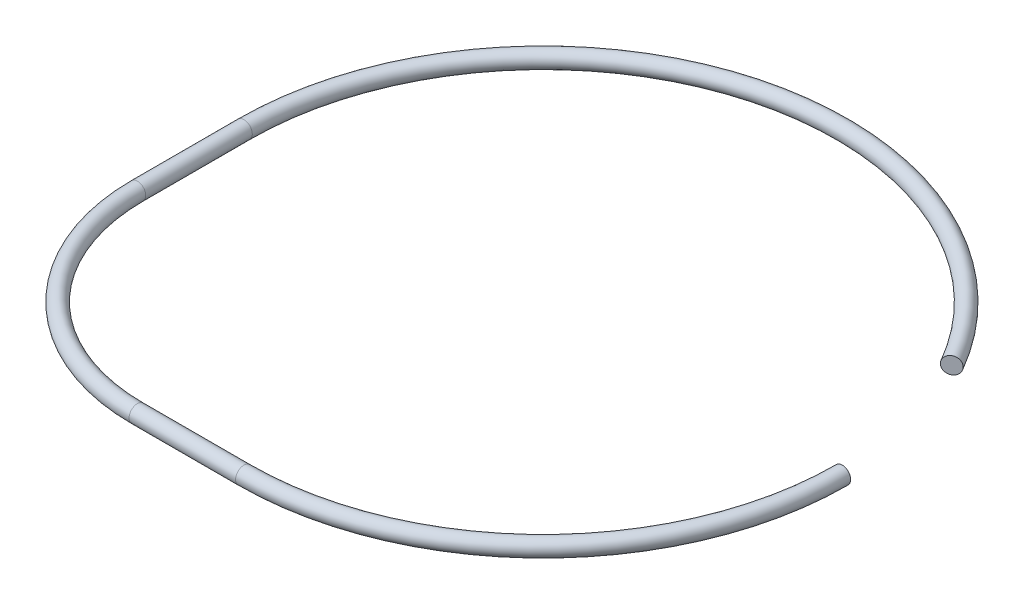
ISO-10303-21;
HEADER;
FILE_DESCRIPTION(('STEP AP214'),'2;1');
FILE_NAME('part.step','',(''),(''),'','','');
FILE_SCHEMA(('AUTOMOTIVE_DESIGN { 1 0 10303 214 1 1 1 1 }'));
ENDSEC;
DATA;
#1=APPLICATION_CONTEXT('core data for automotive mechanical design processes');
#2=APPLICATION_PROTOCOL_DEFINITION('international standard','automotive_design',2000,#1);
#3=PRODUCT_CONTEXT('',#1,'mechanical');
#4=PRODUCT('Part','Part','',(#3));
#5=PRODUCT_RELATED_PRODUCT_CATEGORY('part','',(#4));
#6=PRODUCT_DEFINITION_FORMATION('','',#4);
#7=PRODUCT_DEFINITION_CONTEXT('part definition',#1,'design');
#8=PRODUCT_DEFINITION('design','',#6,#7);
#9=PRODUCT_DEFINITION_SHAPE('','',#8);
#10=(LENGTH_UNIT() NAMED_UNIT(*) SI_UNIT(.MILLI.,.METRE.));
#11=(NAMED_UNIT(*) PLANE_ANGLE_UNIT() SI_UNIT($,.RADIAN.));
#12=(NAMED_UNIT(*) SI_UNIT($,.STERADIAN.) SOLID_ANGLE_UNIT());
#13=UNCERTAINTY_MEASURE_WITH_UNIT(LENGTH_MEASURE(1.E-05),#10,'distance_accuracy_value','');
#14=(GEOMETRIC_REPRESENTATION_CONTEXT(3) GLOBAL_UNCERTAINTY_ASSIGNED_CONTEXT((#13)) GLOBAL_UNIT_ASSIGNED_CONTEXT((#10,
#11,#12)) REPRESENTATION_CONTEXT('',''));
#15=CARTESIAN_POINT('',(0.,0.,0.));
#16=DIRECTION('',(0.,0.,1.));
#17=DIRECTION('',(1.,0.,0.));
#18=AXIS2_PLACEMENT_3D('',#15,#16,#17);
#19=CARTESIAN_POINT('',(0.,0.,0.));
#20=DIRECTION('',(0.,-1.,0.));
#21=DIRECTION('',(0.,0.,-1.));
#22=AXIS2_PLACEMENT_3D('',#19,#20,#21);
#23=TOROIDAL_SURFACE('',#22,56.7499500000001,1.5875);
#24=CARTESIAN_POINT('',(-56.7499500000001,0.,0.));
#25=DIRECTION('',(0.,0.,-1.));
#26=DIRECTION('',(-1.,0.,0.));
#27=AXIS2_PLACEMENT_3D('',#24,#25,#26);
#28=CIRCLE('',#27,1.5875);
#29=CARTESIAN_POINT('',(-58.3374500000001,0.,0.));
#30=VERTEX_POINT('',#29);
#31=EDGE_CURVE('E38',#30,#30,#28,.T.);
#32=CARTESIAN_POINT('',(49.1468983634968,0.,-28.3749749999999));
#33=DIRECTION('',(0.499999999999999,0.,0.866025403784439));
#34=DIRECTION('',(0.866025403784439,0.,-0.499999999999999));
#35=AXIS2_PLACEMENT_3D('',#32,#33,#34);
#36=CIRCLE('',#35,1.5875);
#37=CARTESIAN_POINT('',(50.5217136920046,0.,-29.1687249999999));
#38=VERTEX_POINT('',#37);
#39=EDGE_CURVE('E10',#38,#38,#36,.T.);
#40=CARTESIAN_POINT('',(0.,0.,0.));
#41=DIRECTION('',(0.,-1.,0.));
#42=DIRECTION('',(0.,0.,-1.));
#43=AXIS2_PLACEMENT_3D('',#40,#41,#42);
#44=CIRCLE('',#43,58.3374500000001);
#45=EDGE_CURVE('',#30,#38,#44,.T.);
#46=ORIENTED_EDGE('',*,*,#31,.T.);
#47=ORIENTED_EDGE('',*,*,#39,.F.);
#48=ORIENTED_EDGE('',*,*,#45,.T.);
#49=ORIENTED_EDGE('',*,*,#45,.F.);
#50=EDGE_LOOP('',(#46,#48,#47,#49));
#51=FACE_BOUND('',#50,.T.);
#52=ADVANCED_FACE('F32',(#51),#23,.T.);
#53=CARTESIAN_POINT('',(-56.74995,0.,20.2055762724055));
#54=DIRECTION('',(0.,0.,-1.));
#55=DIRECTION('',(-1.,0.,0.));
#56=AXIS2_PLACEMENT_3D('',#53,#54,#55);
#57=CYLINDRICAL_SURFACE('',#56,1.5875);
#58=CARTESIAN_POINT('',(-56.74995,0.,20.2055762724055));
#59=DIRECTION('',(0.,0.,-1.));
#60=DIRECTION('',(-1.,0.,0.));
#61=AXIS2_PLACEMENT_3D('',#58,#59,#60);
#62=CIRCLE('',#61,1.5875);
#63=CARTESIAN_POINT('',(-58.33745,0.,20.2055762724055));
#64=VERTEX_POINT('',#63);
#65=EDGE_CURVE('E42',#64,#64,#62,.T.);
#66=ORIENTED_EDGE('',*,*,#65,.T.);
#67=EDGE_LOOP('',(#66));
#68=FACE_BOUND('',#67,.T.);
#69=ORIENTED_EDGE('',*,*,#31,.F.);
#70=EDGE_LOOP('',(#69));
#71=FACE_BOUND('',#70,.T.);
#72=ADVANCED_FACE('F69',(#68,#71),#57,.T.);
#73=CARTESIAN_POINT('',(-20.2055762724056,0.,20.2055762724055));
#74=DIRECTION('',(0.,-1.,0.));
#75=DIRECTION('',(0.,0.,-1.));
#76=AXIS2_PLACEMENT_3D('',#73,#74,#75);
#77=TOROIDAL_SURFACE('',#76,36.5443737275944,1.5875);
#78=CARTESIAN_POINT('',(-20.2055762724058,0.,56.74995));
#79=DIRECTION('',(-1.,0.,0.));
#80=DIRECTION('',(0.,0.,1.));
#81=AXIS2_PLACEMENT_3D('',#78,#79,#80);
#82=CIRCLE('',#81,1.5875);
#83=CARTESIAN_POINT('',(-20.2055762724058,0.,58.33745));
#84=VERTEX_POINT('',#83);
#85=EDGE_CURVE('E46',#84,#84,#82,.T.);
#86=CARTESIAN_POINT('',(-20.2055762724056,0.,20.2055762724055));
#87=DIRECTION('',(0.,-1.,0.));
#88=DIRECTION('',(0.,0.,-1.));
#89=AXIS2_PLACEMENT_3D('',#86,#87,#88);
#90=CIRCLE('',#89,38.1318737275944);
#91=EDGE_CURVE('',#84,#64,#90,.T.);
#92=ORIENTED_EDGE('',*,*,#85,.T.);
#93=ORIENTED_EDGE('',*,*,#65,.F.);
#94=ORIENTED_EDGE('',*,*,#91,.T.);
#95=ORIENTED_EDGE('',*,*,#91,.F.);
#96=EDGE_LOOP('',(#92,#94,#93,#95));
#97=FACE_BOUND('',#96,.T.);
#98=ADVANCED_FACE('F73',(#97),#77,.T.);
#99=CARTESIAN_POINT('',(-1.98141391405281E-13,0.,56.74995));
#100=DIRECTION('',(-1.,0.,0.));
#101=DIRECTION('',(0.,0.,1.));
#102=AXIS2_PLACEMENT_3D('',#99,#100,#101);
#103=CYLINDRICAL_SURFACE('',#102,1.5875);
#104=CARTESIAN_POINT('',(-1.98141391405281E-13,0.,56.74995));
#105=DIRECTION('',(-1.,0.,0.));
#106=DIRECTION('',(0.,0.,1.));
#107=AXIS2_PLACEMENT_3D('',#104,#105,#106);
#108=CIRCLE('',#107,1.5875);
#109=CARTESIAN_POINT('',(-2.03684118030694E-13,0.,58.33745));
#110=VERTEX_POINT('',#109);
#111=EDGE_CURVE('E51',#110,#110,#108,.T.);
#112=ORIENTED_EDGE('',*,*,#111,.T.);
#113=EDGE_LOOP('',(#112));
#114=FACE_BOUND('',#113,.T.);
#115=ORIENTED_EDGE('',*,*,#85,.F.);
#116=EDGE_LOOP('',(#115));
#117=FACE_BOUND('',#116,.T.);
#118=ADVANCED_FACE('F79',(#114,#117),#103,.T.);
#119=CARTESIAN_POINT('',(0.,0.,0.));
#120=DIRECTION('',(0.,1.,0.));
#121=DIRECTION('',(0.,0.,1.));
#122=AXIS2_PLACEMENT_3D('',#119,#120,#121);
#123=TOROIDAL_SURFACE('',#122,56.74995,1.5875);
#124=CARTESIAN_POINT('',(56.74995,0.,0.));
#125=DIRECTION('',(0.,0.,1.));
#126=DIRECTION('',(1.,0.,0.));
#127=AXIS2_PLACEMENT_3D('',#124,#125,#126);
#128=CIRCLE('',#127,1.5875);
#129=CARTESIAN_POINT('',(58.33745,0.,0.));
#130=VERTEX_POINT('',#129);
#131=EDGE_CURVE('E54',#130,#130,#128,.T.);
#132=CARTESIAN_POINT('',(0.,0.,0.));
#133=DIRECTION('',(0.,1.,0.));
#134=DIRECTION('',(0.,0.,1.));
#135=AXIS2_PLACEMENT_3D('',#132,#133,#134);
#136=CIRCLE('',#135,58.33745);
#137=EDGE_CURVE('',#110,#130,#136,.T.);
#138=ORIENTED_EDGE('',*,*,#111,.F.);
#139=ORIENTED_EDGE('',*,*,#131,.T.);
#140=ORIENTED_EDGE('',*,*,#137,.T.);
#141=ORIENTED_EDGE('',*,*,#137,.F.);
#142=EDGE_LOOP('',(#138,#140,#139,#141));
#143=FACE_BOUND('',#142,.T.);
#144=ADVANCED_FACE('F58',(#143),#123,.T.);
#145=CARTESIAN_POINT('',(49.1468983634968,0.,-28.3749749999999));
#146=DIRECTION('',(0.499999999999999,0.,0.866025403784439));
#147=DIRECTION('',(0.866025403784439,0.,-0.499999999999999));
#148=AXIS2_PLACEMENT_3D('',#145,#146,#147);
#149=PLANE('',#148);
#150=ORIENTED_EDGE('',*,*,#39,.T.);
#151=EDGE_LOOP('',(#150));
#152=FACE_BOUND('',#151,.T.);
#153=ADVANCED_FACE('F62',(#152),#149,.T.);
#154=CARTESIAN_POINT('',(56.74995,0.,0.));
#155=DIRECTION('',(0.,0.,1.));
#156=DIRECTION('',(1.,0.,0.));
#157=AXIS2_PLACEMENT_3D('',#154,#155,#156);
#158=PLANE('',#157);
#159=ORIENTED_EDGE('',*,*,#131,.F.);
#160=EDGE_LOOP('',(#159));
#161=FACE_BOUND('',#160,.T.);
#162=ADVANCED_FACE('F60',(#161),#158,.F.);
#163=CLOSED_SHELL('',(#52,#72,#98,#118,#144,#153,#162));
#164=MANIFOLD_SOLID_BREP('B2',#163);
#165=ADVANCED_BREP_SHAPE_REPRESENTATION('',(#18,#164),#14);
#166=SHAPE_DEFINITION_REPRESENTATION(#9,#165);
ENDSEC;
END-ISO-10303-21;
